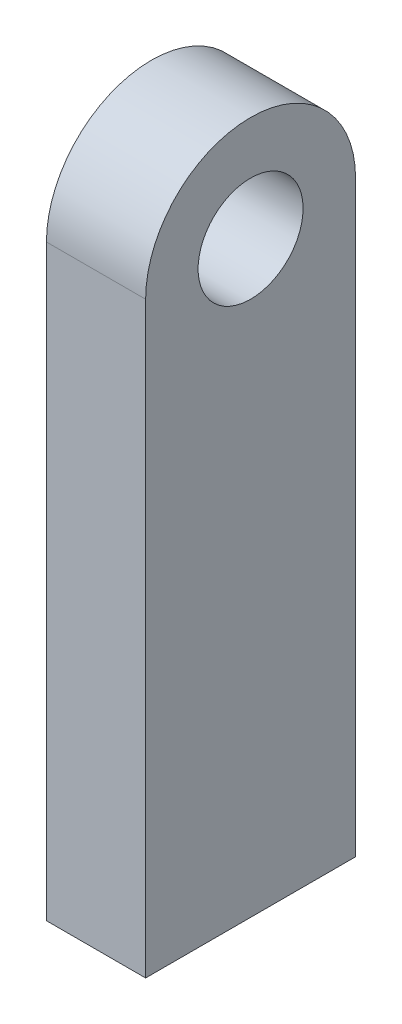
ISO-10303-21;
HEADER;
FILE_DESCRIPTION(('STEP AP214'),'2;1');
FILE_NAME('part.step','',(''),(''),'','','');
FILE_SCHEMA(('AUTOMOTIVE_DESIGN { 1 0 10303 214 1 1 1 1 }'));
ENDSEC;
DATA;
#1=APPLICATION_CONTEXT('core data for automotive mechanical design processes');
#2=APPLICATION_PROTOCOL_DEFINITION('international standard','automotive_design',2000,#1);
#3=PRODUCT_CONTEXT('',#1,'mechanical');
#4=PRODUCT('Part','Part','',(#3));
#5=PRODUCT_RELATED_PRODUCT_CATEGORY('part','',(#4));
#6=PRODUCT_DEFINITION_FORMATION('','',#4);
#7=PRODUCT_DEFINITION_CONTEXT('part definition',#1,'design');
#8=PRODUCT_DEFINITION('design','',#6,#7);
#9=PRODUCT_DEFINITION_SHAPE('','',#8);
#10=(LENGTH_UNIT() NAMED_UNIT(*) SI_UNIT(.MILLI.,.METRE.));
#11=(NAMED_UNIT(*) PLANE_ANGLE_UNIT() SI_UNIT($,.RADIAN.));
#12=(NAMED_UNIT(*) SI_UNIT($,.STERADIAN.) SOLID_ANGLE_UNIT());
#13=UNCERTAINTY_MEASURE_WITH_UNIT(LENGTH_MEASURE(1.E-05),#10,'distance_accuracy_value','');
#14=(GEOMETRIC_REPRESENTATION_CONTEXT(3) GLOBAL_UNCERTAINTY_ASSIGNED_CONTEXT((#13)) GLOBAL_UNIT_ASSIGNED_CONTEXT((#10,
#11,#12)) REPRESENTATION_CONTEXT('',''));
#15=CARTESIAN_POINT('',(0.,0.,0.));
#16=DIRECTION('',(0.,0.,1.));
#17=DIRECTION('',(1.,0.,0.));
#18=AXIS2_PLACEMENT_3D('',#15,#16,#17);
#19=CARTESIAN_POINT('',(5.999999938,0.,0.));
#20=DIRECTION('',(-1.,0.,0.));
#21=DIRECTION('',(0.,0.,1.));
#22=AXIS2_PLACEMENT_3D('',#19,#20,#21);
#23=CYLINDRICAL_SURFACE('',#22,6.35);
#24=CARTESIAN_POINT('',(0.,0.,0.));
#25=DIRECTION('',(1.,0.,0.));
#26=DIRECTION('',(0.,0.,-1.));
#27=AXIS2_PLACEMENT_3D('',#24,#25,#26);
#28=CIRCLE('',#27,6.35);
#29=CARTESIAN_POINT('',(0.,0.,-6.35));
#30=VERTEX_POINT('',#29);
#31=CARTESIAN_POINT('',(0.,0.,6.35));
#32=VERTEX_POINT('',#31);
#33=EDGE_CURVE('E120',#30,#32,#28,.T.);
#34=ORIENTED_EDGE('',*,*,#33,.T.);
#35=DIRECTION('',(-1.,0.,0.));
#36=VECTOR('',#35,1.);
#37=CARTESIAN_POINT('',(5.999999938,0.,6.35));
#38=LINE('',#37,#36);
#39=CARTESIAN_POINT('',(5.999999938,0.,6.35));
#40=VERTEX_POINT('',#39);
#41=EDGE_CURVE('E11',#40,#32,#38,.T.);
#42=ORIENTED_EDGE('',*,*,#41,.F.);
#43=CARTESIAN_POINT('',(5.999999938,0.,0.));
#44=DIRECTION('',(1.,0.,0.));
#45=DIRECTION('',(0.,0.,-1.));
#46=AXIS2_PLACEMENT_3D('',#43,#44,#45);
#47=CIRCLE('',#46,6.35);
#48=CARTESIAN_POINT('',(5.999999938,0.,-6.35));
#49=VERTEX_POINT('',#48);
#50=EDGE_CURVE('E98',#49,#40,#47,.T.);
#51=ORIENTED_EDGE('',*,*,#50,.F.);
#52=DIRECTION('',(-1.,0.,0.));
#53=VECTOR('',#52,1.);
#54=CARTESIAN_POINT('',(5.999999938,0.,-6.35));
#55=LINE('',#54,#53);
#56=EDGE_CURVE('E65',#49,#30,#55,.T.);
#57=ORIENTED_EDGE('',*,*,#56,.T.);
#58=EDGE_LOOP('',(#34,#42,#51,#57));
#59=FACE_BOUND('',#58,.T.);
#60=ADVANCED_FACE('F47',(#59),#23,.T.);
#61=CARTESIAN_POINT('',(5.999999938,0.,6.35));
#62=DIRECTION('',(0.,0.,-1.));
#63=DIRECTION('',(0.,1.,0.));
#64=AXIS2_PLACEMENT_3D('',#61,#62,#63);
#65=PLANE('',#64);
#66=DIRECTION('',(0.,-1.,0.));
#67=VECTOR('',#66,1.);
#68=CARTESIAN_POINT('',(0.,0.,6.35));
#69=LINE('',#68,#67);
#70=CARTESIAN_POINT('',(0.,-35.56,6.35));
#71=VERTEX_POINT('',#70);
#72=EDGE_CURVE('E104',#32,#71,#69,.T.);
#73=ORIENTED_EDGE('',*,*,#72,.T.);
#74=DIRECTION('',(-1.,0.,0.));
#75=VECTOR('',#74,1.);
#76=CARTESIAN_POINT('',(5.999999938,-35.56,6.35));
#77=LINE('',#76,#75);
#78=CARTESIAN_POINT('',(5.999999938,-35.56,6.35));
#79=VERTEX_POINT('',#78);
#80=EDGE_CURVE('E57',#79,#71,#77,.T.);
#81=ORIENTED_EDGE('',*,*,#80,.F.);
#82=DIRECTION('',(0.,-1.,0.));
#83=VECTOR('',#82,1.);
#84=CARTESIAN_POINT('',(5.999999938,0.,6.35));
#85=LINE('',#84,#83);
#86=EDGE_CURVE('E91',#40,#79,#85,.T.);
#87=ORIENTED_EDGE('',*,*,#86,.F.);
#88=ORIENTED_EDGE('',*,*,#41,.T.);
#89=EDGE_LOOP('',(#73,#81,#87,#88));
#90=FACE_BOUND('',#89,.T.);
#91=ADVANCED_FACE('F103',(#90),#65,.F.);
#92=CARTESIAN_POINT('',(5.999999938,-35.56,0.));
#93=DIRECTION('',(0.,1.,0.));
#94=DIRECTION('',(0.,0.,1.));
#95=AXIS2_PLACEMENT_3D('',#92,#93,#94);
#96=PLANE('',#95);
#97=DIRECTION('',(0.,0.,-1.));
#98=VECTOR('',#97,1.);
#99=CARTESIAN_POINT('',(0.,-35.56,0.));
#100=LINE('',#99,#98);
#101=CARTESIAN_POINT('',(0.,-35.56,-6.35));
#102=VERTEX_POINT('',#101);
#103=EDGE_CURVE('E125',#71,#102,#100,.T.);
#104=ORIENTED_EDGE('',*,*,#103,.T.);
#105=DIRECTION('',(-1.,0.,0.));
#106=VECTOR('',#105,1.);
#107=CARTESIAN_POINT('',(5.999999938,-35.56,-6.35));
#108=LINE('',#107,#106);
#109=CARTESIAN_POINT('',(5.999999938,-35.56,-6.35));
#110=VERTEX_POINT('',#109);
#111=EDGE_CURVE('E80',#110,#102,#108,.T.);
#112=ORIENTED_EDGE('',*,*,#111,.F.);
#113=DIRECTION('',(0.,0.,-1.));
#114=VECTOR('',#113,1.);
#115=CARTESIAN_POINT('',(5.999999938,-35.56,0.));
#116=LINE('',#115,#114);
#117=EDGE_CURVE('E97',#79,#110,#116,.T.);
#118=ORIENTED_EDGE('',*,*,#117,.F.);
#119=ORIENTED_EDGE('',*,*,#80,.T.);
#120=EDGE_LOOP('',(#104,#112,#118,#119));
#121=FACE_BOUND('',#120,.T.);
#122=ADVANCED_FACE('F108',(#121),#96,.F.);
#123=CARTESIAN_POINT('',(5.999999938,0.,0.));
#124=DIRECTION('',(-1.,0.,0.));
#125=DIRECTION('',(0.,0.,1.));
#126=AXIS2_PLACEMENT_3D('',#123,#124,#125);
#127=CYLINDRICAL_SURFACE('',#126,3.175);
#128=CARTESIAN_POINT('',(5.999999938,0.,0.));
#129=DIRECTION('',(1.,0.,0.));
#130=DIRECTION('',(0.,0.,-1.));
#131=AXIS2_PLACEMENT_3D('',#128,#129,#130);
#132=CIRCLE('',#131,3.175);
#133=CARTESIAN_POINT('',(5.999999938,0.,-3.175));
#134=VERTEX_POINT('',#133);
#135=EDGE_CURVE('E132',#134,#134,#132,.T.);
#136=ORIENTED_EDGE('',*,*,#135,.T.);
#137=EDGE_LOOP('',(#136));
#138=FACE_BOUND('',#137,.T.);
#139=CARTESIAN_POINT('',(0.,0.,0.));
#140=DIRECTION('',(1.,0.,0.));
#141=DIRECTION('',(0.,0.,-1.));
#142=AXIS2_PLACEMENT_3D('',#139,#140,#141);
#143=CIRCLE('',#142,3.175);
#144=CARTESIAN_POINT('',(0.,0.,-3.175));
#145=VERTEX_POINT('',#144);
#146=EDGE_CURVE('E116',#145,#145,#143,.T.);
#147=ORIENTED_EDGE('',*,*,#146,.F.);
#148=EDGE_LOOP('',(#147));
#149=FACE_BOUND('',#148,.T.);
#150=ADVANCED_FACE('F49',(#138,#149),#127,.F.);
#151=CARTESIAN_POINT('',(5.999999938,0.,-6.35));
#152=DIRECTION('',(0.,0.,-1.));
#153=DIRECTION('',(0.,1.,0.));
#154=AXIS2_PLACEMENT_3D('',#151,#152,#153);
#155=PLANE('',#154);
#156=DIRECTION('',(0.,-1.,0.));
#157=VECTOR('',#156,1.);
#158=CARTESIAN_POINT('',(0.,0.,-6.35));
#159=LINE('',#158,#157);
#160=EDGE_CURVE('E128',#30,#102,#159,.T.);
#161=ORIENTED_EDGE('',*,*,#160,.F.);
#162=ORIENTED_EDGE('',*,*,#56,.F.);
#163=DIRECTION('',(0.,-1.,0.));
#164=VECTOR('',#163,1.);
#165=CARTESIAN_POINT('',(5.999999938,0.,-6.35));
#166=LINE('',#165,#164);
#167=EDGE_CURVE('E110',#49,#110,#166,.T.);
#168=ORIENTED_EDGE('',*,*,#167,.T.);
#169=ORIENTED_EDGE('',*,*,#111,.T.);
#170=EDGE_LOOP('',(#161,#162,#168,#169));
#171=FACE_BOUND('',#170,.T.);
#172=ADVANCED_FACE('F147',(#171),#155,.T.);
#173=CARTESIAN_POINT('',(5.999999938,0.,0.));
#174=DIRECTION('',(1.,0.,0.));
#175=DIRECTION('',(0.,0.,-1.));
#176=AXIS2_PLACEMENT_3D('',#173,#174,#175);
#177=PLANE('',#176);
#178=ORIENTED_EDGE('',*,*,#135,.F.);
#179=EDGE_LOOP('',(#178));
#180=FACE_BOUND('',#179,.T.);
#181=ORIENTED_EDGE('',*,*,#50,.T.);
#182=ORIENTED_EDGE('',*,*,#86,.T.);
#183=ORIENTED_EDGE('',*,*,#117,.T.);
#184=ORIENTED_EDGE('',*,*,#167,.F.);
#185=EDGE_LOOP('',(#181,#182,#183,#184));
#186=FACE_BOUND('',#185,.T.);
#187=ADVANCED_FACE('F94',(#180,#186),#177,.T.);
#188=CARTESIAN_POINT('',(0.,0.,0.));
#189=DIRECTION('',(1.,0.,0.));
#190=DIRECTION('',(0.,0.,-1.));
#191=AXIS2_PLACEMENT_3D('',#188,#189,#190);
#192=PLANE('',#191);
#193=ORIENTED_EDGE('',*,*,#146,.T.);
#194=EDGE_LOOP('',(#193));
#195=FACE_BOUND('',#194,.T.);
#196=ORIENTED_EDGE('',*,*,#33,.F.);
#197=ORIENTED_EDGE('',*,*,#160,.T.);
#198=ORIENTED_EDGE('',*,*,#103,.F.);
#199=ORIENTED_EDGE('',*,*,#72,.F.);
#200=EDGE_LOOP('',(#196,#197,#198,#199));
#201=FACE_BOUND('',#200,.T.);
#202=ADVANCED_FACE('F146',(#195,#201),#192,.F.);
#203=CLOSED_SHELL('',(#60,#91,#122,#150,#172,#187,#202));
#204=MANIFOLD_SOLID_BREP('B2',#203);
#205=ADVANCED_BREP_SHAPE_REPRESENTATION('',(#18,#204),#14);
#206=SHAPE_DEFINITION_REPRESENTATION(#9,#205);
ENDSEC;
END-ISO-10303-21;
